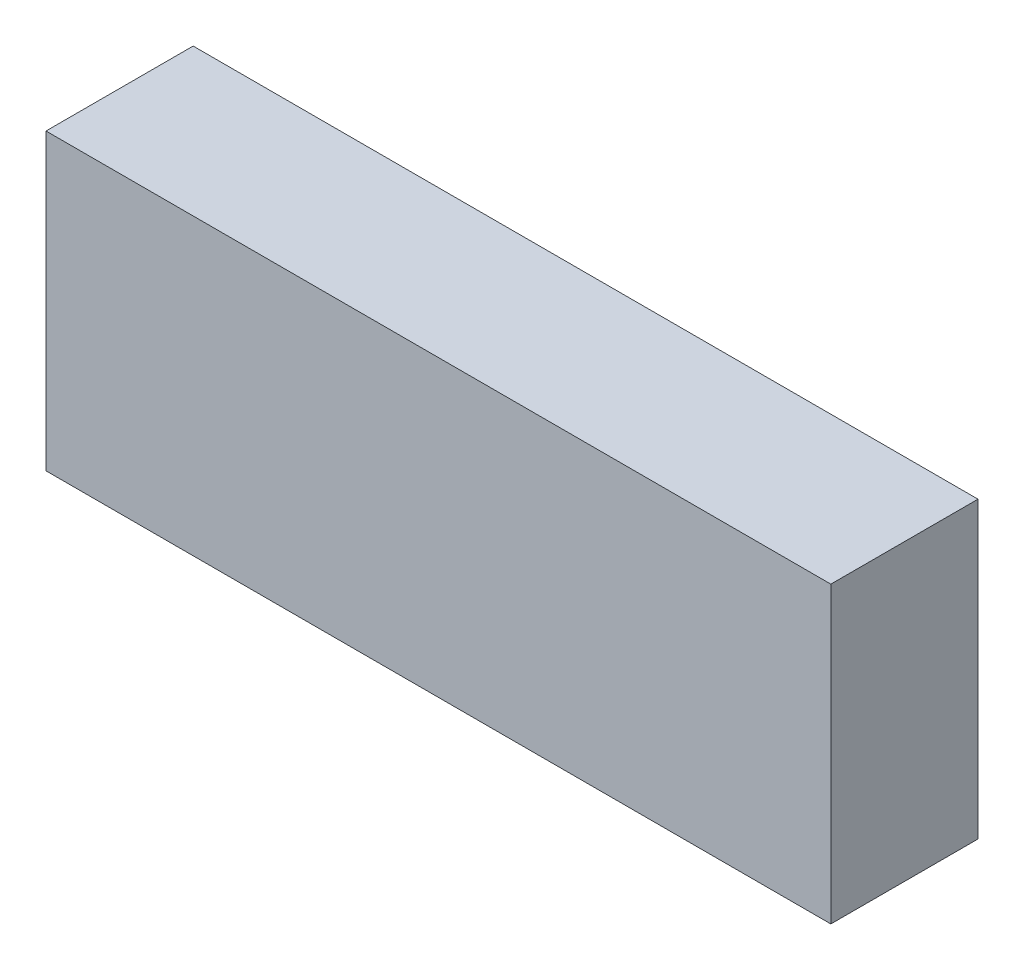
ISO-10303-21;
HEADER;
FILE_DESCRIPTION(('STEP AP214'),'2;1');
FILE_NAME('part.step','',(''),(''),'','','');
FILE_SCHEMA(('AUTOMOTIVE_DESIGN { 1 0 10303 214 1 1 1 1 }'));
ENDSEC;
DATA;
#1=APPLICATION_CONTEXT('core data for automotive mechanical design processes');
#2=APPLICATION_PROTOCOL_DEFINITION('international standard','automotive_design',2000,#1);
#3=PRODUCT_CONTEXT('',#1,'mechanical');
#4=PRODUCT('Part','Part','',(#3));
#5=PRODUCT_RELATED_PRODUCT_CATEGORY('part','',(#4));
#6=PRODUCT_DEFINITION_FORMATION('','',#4);
#7=PRODUCT_DEFINITION_CONTEXT('part definition',#1,'design');
#8=PRODUCT_DEFINITION('design','',#6,#7);
#9=PRODUCT_DEFINITION_SHAPE('','',#8);
#10=(LENGTH_UNIT() NAMED_UNIT(*) SI_UNIT(.MILLI.,.METRE.));
#11=(NAMED_UNIT(*) PLANE_ANGLE_UNIT() SI_UNIT($,.RADIAN.));
#12=(NAMED_UNIT(*) SI_UNIT($,.STERADIAN.) SOLID_ANGLE_UNIT());
#13=UNCERTAINTY_MEASURE_WITH_UNIT(LENGTH_MEASURE(1.E-05),#10,'distance_accuracy_value','');
#14=(GEOMETRIC_REPRESENTATION_CONTEXT(3) GLOBAL_UNCERTAINTY_ASSIGNED_CONTEXT((#13)) GLOBAL_UNIT_ASSIGNED_CONTEXT((#10,
#11,#12)) REPRESENTATION_CONTEXT('',''));
#15=CARTESIAN_POINT('',(0.,0.,0.));
#16=DIRECTION('',(0.,0.,1.));
#17=DIRECTION('',(1.,0.,0.));
#18=AXIS2_PLACEMENT_3D('',#15,#16,#17);
#19=CARTESIAN_POINT('',(101.6,76.2,19.05));
#20=DIRECTION('',(-1.,0.,0.));
#21=DIRECTION('',(0.,0.,1.));
#22=AXIS2_PLACEMENT_3D('',#19,#20,#21);
#23=PLANE('',#22);
#24=DIRECTION('',(0.,0.,-1.));
#25=VECTOR('',#24,1.);
#26=CARTESIAN_POINT('',(101.6,0.,19.05));
#27=LINE('',#26,#25);
#28=CARTESIAN_POINT('',(101.6,0.,19.05));
#29=VERTEX_POINT('',#28);
#30=CARTESIAN_POINT('',(101.6,0.,-19.05));
#31=VERTEX_POINT('',#30);
#32=EDGE_CURVE('E95',#29,#31,#27,.T.);
#33=ORIENTED_EDGE('',*,*,#32,.T.);
#34=DIRECTION('',(0.,-1.,0.));
#35=VECTOR('',#34,1.);
#36=CARTESIAN_POINT('',(101.6,76.2,-19.05));
#37=LINE('',#36,#35);
#38=CARTESIAN_POINT('',(101.6,76.2,-19.05));
#39=VERTEX_POINT('',#38);
#40=EDGE_CURVE('E11',#39,#31,#37,.T.);
#41=ORIENTED_EDGE('',*,*,#40,.F.);
#42=DIRECTION('',(0.,0.,-1.));
#43=VECTOR('',#42,1.);
#44=CARTESIAN_POINT('',(101.6,76.2,19.05));
#45=LINE('',#44,#43);
#46=CARTESIAN_POINT('',(101.6,76.2,19.05));
#47=VERTEX_POINT('',#46);
#48=EDGE_CURVE('E83',#47,#39,#45,.T.);
#49=ORIENTED_EDGE('',*,*,#48,.F.);
#50=DIRECTION('',(0.,-1.,0.));
#51=VECTOR('',#50,1.);
#52=CARTESIAN_POINT('',(101.6,76.2,19.05));
#53=LINE('',#52,#51);
#54=EDGE_CURVE('E91',#47,#29,#53,.T.);
#55=ORIENTED_EDGE('',*,*,#54,.T.);
#56=EDGE_LOOP('',(#33,#41,#49,#55));
#57=FACE_BOUND('',#56,.T.);
#58=ADVANCED_FACE('F32',(#57),#23,.F.);
#59=CARTESIAN_POINT('',(-101.6,76.2,-19.05));
#60=DIRECTION('',(0.,0.,1.));
#61=DIRECTION('',(1.,0.,0.));
#62=AXIS2_PLACEMENT_3D('',#59,#60,#61);
#63=PLANE('',#62);
#64=DIRECTION('',(-1.,0.,0.));
#65=VECTOR('',#64,1.);
#66=CARTESIAN_POINT('',(-101.6,0.,-19.05));
#67=LINE('',#66,#65);
#68=CARTESIAN_POINT('',(-101.6,0.,-19.05));
#69=VERTEX_POINT('',#68);
#70=EDGE_CURVE('E87',#31,#69,#67,.T.);
#71=ORIENTED_EDGE('',*,*,#70,.T.);
#72=DIRECTION('',(0.,-1.,0.));
#73=VECTOR('',#72,1.);
#74=CARTESIAN_POINT('',(-101.6,76.2,-19.05));
#75=LINE('',#74,#73);
#76=CARTESIAN_POINT('',(-101.6,76.2,-19.05));
#77=VERTEX_POINT('',#76);
#78=EDGE_CURVE('E40',#77,#69,#75,.T.);
#79=ORIENTED_EDGE('',*,*,#78,.F.);
#80=DIRECTION('',(-1.,0.,0.));
#81=VECTOR('',#80,1.);
#82=CARTESIAN_POINT('',(-101.6,76.2,-19.05));
#83=LINE('',#82,#81);
#84=EDGE_CURVE('E78',#39,#77,#83,.T.);
#85=ORIENTED_EDGE('',*,*,#84,.F.);
#86=ORIENTED_EDGE('',*,*,#40,.T.);
#87=EDGE_LOOP('',(#71,#79,#85,#86));
#88=FACE_BOUND('',#87,.T.);
#89=ADVANCED_FACE('F86',(#88),#63,.F.);
#90=CARTESIAN_POINT('',(-101.6,76.2,19.05));
#91=DIRECTION('',(1.,0.,0.));
#92=DIRECTION('',(0.,0.,-1.));
#93=AXIS2_PLACEMENT_3D('',#90,#91,#92);
#94=PLANE('',#93);
#95=DIRECTION('',(0.,0.,1.));
#96=VECTOR('',#95,1.);
#97=CARTESIAN_POINT('',(-101.6,0.,19.05));
#98=LINE('',#97,#96);
#99=CARTESIAN_POINT('',(-101.6,0.,19.05));
#100=VERTEX_POINT('',#99);
#101=EDGE_CURVE('E65',#69,#100,#98,.T.);
#102=ORIENTED_EDGE('',*,*,#101,.T.);
#103=DIRECTION('',(0.,-1.,0.));
#104=VECTOR('',#103,1.);
#105=CARTESIAN_POINT('',(-101.6,76.2,19.05));
#106=LINE('',#105,#104);
#107=CARTESIAN_POINT('',(-101.6,76.2,19.05));
#108=VERTEX_POINT('',#107);
#109=EDGE_CURVE('E88',#108,#100,#106,.T.);
#110=ORIENTED_EDGE('',*,*,#109,.F.);
#111=DIRECTION('',(0.,0.,1.));
#112=VECTOR('',#111,1.);
#113=CARTESIAN_POINT('',(-101.6,76.2,19.05));
#114=LINE('',#113,#112);
#115=EDGE_CURVE('E81',#77,#108,#114,.T.);
#116=ORIENTED_EDGE('',*,*,#115,.F.);
#117=ORIENTED_EDGE('',*,*,#78,.T.);
#118=EDGE_LOOP('',(#102,#110,#116,#117));
#119=FACE_BOUND('',#118,.T.);
#120=ADVANCED_FACE('F89',(#119),#94,.F.);
#121=CARTESIAN_POINT('',(-101.6,76.2,19.05));
#122=DIRECTION('',(0.,0.,-1.));
#123=DIRECTION('',(-1.,0.,0.));
#124=AXIS2_PLACEMENT_3D('',#121,#122,#123);
#125=PLANE('',#124);
#126=DIRECTION('',(1.,0.,0.));
#127=VECTOR('',#126,1.);
#128=CARTESIAN_POINT('',(-101.6,0.,19.05));
#129=LINE('',#128,#127);
#130=EDGE_CURVE('E71',#100,#29,#129,.T.);
#131=ORIENTED_EDGE('',*,*,#130,.T.);
#132=ORIENTED_EDGE('',*,*,#54,.F.);
#133=DIRECTION('',(1.,0.,0.));
#134=VECTOR('',#133,1.);
#135=CARTESIAN_POINT('',(-101.6,76.2,19.05));
#136=LINE('',#135,#134);
#137=EDGE_CURVE('E48',#108,#47,#136,.T.);
#138=ORIENTED_EDGE('',*,*,#137,.F.);
#139=ORIENTED_EDGE('',*,*,#109,.T.);
#140=EDGE_LOOP('',(#131,#132,#138,#139));
#141=FACE_BOUND('',#140,.T.);
#142=ADVANCED_FACE('F102',(#141),#125,.F.);
#143=CARTESIAN_POINT('',(0.,76.2,0.));
#144=DIRECTION('',(0.,-1.,0.));
#145=DIRECTION('',(0.,0.,-1.));
#146=AXIS2_PLACEMENT_3D('',#143,#144,#145);
#147=PLANE('',#146);
#148=ORIENTED_EDGE('',*,*,#48,.T.);
#149=ORIENTED_EDGE('',*,*,#84,.T.);
#150=ORIENTED_EDGE('',*,*,#115,.T.);
#151=ORIENTED_EDGE('',*,*,#137,.T.);
#152=EDGE_LOOP('',(#148,#149,#150,#151));
#153=FACE_BOUND('',#152,.T.);
#154=ADVANCED_FACE('F79',(#153),#147,.F.);
#155=CARTESIAN_POINT('',(0.,0.,0.));
#156=DIRECTION('',(0.,-1.,0.));
#157=DIRECTION('',(0.,0.,-1.));
#158=AXIS2_PLACEMENT_3D('',#155,#156,#157);
#159=PLANE('',#158);
#160=ORIENTED_EDGE('',*,*,#32,.F.);
#161=ORIENTED_EDGE('',*,*,#130,.F.);
#162=ORIENTED_EDGE('',*,*,#101,.F.);
#163=ORIENTED_EDGE('',*,*,#70,.F.);
#164=EDGE_LOOP('',(#160,#161,#162,#163));
#165=FACE_BOUND('',#164,.T.);
#166=ADVANCED_FACE('F105',(#165),#159,.T.);
#167=CLOSED_SHELL('',(#58,#89,#120,#142,#154,#166));
#168=MANIFOLD_SOLID_BREP('B2',#167);
#169=ADVANCED_BREP_SHAPE_REPRESENTATION('',(#18,#168),#14);
#170=SHAPE_DEFINITION_REPRESENTATION(#9,#169);
ENDSEC;
END-ISO-10303-21;
